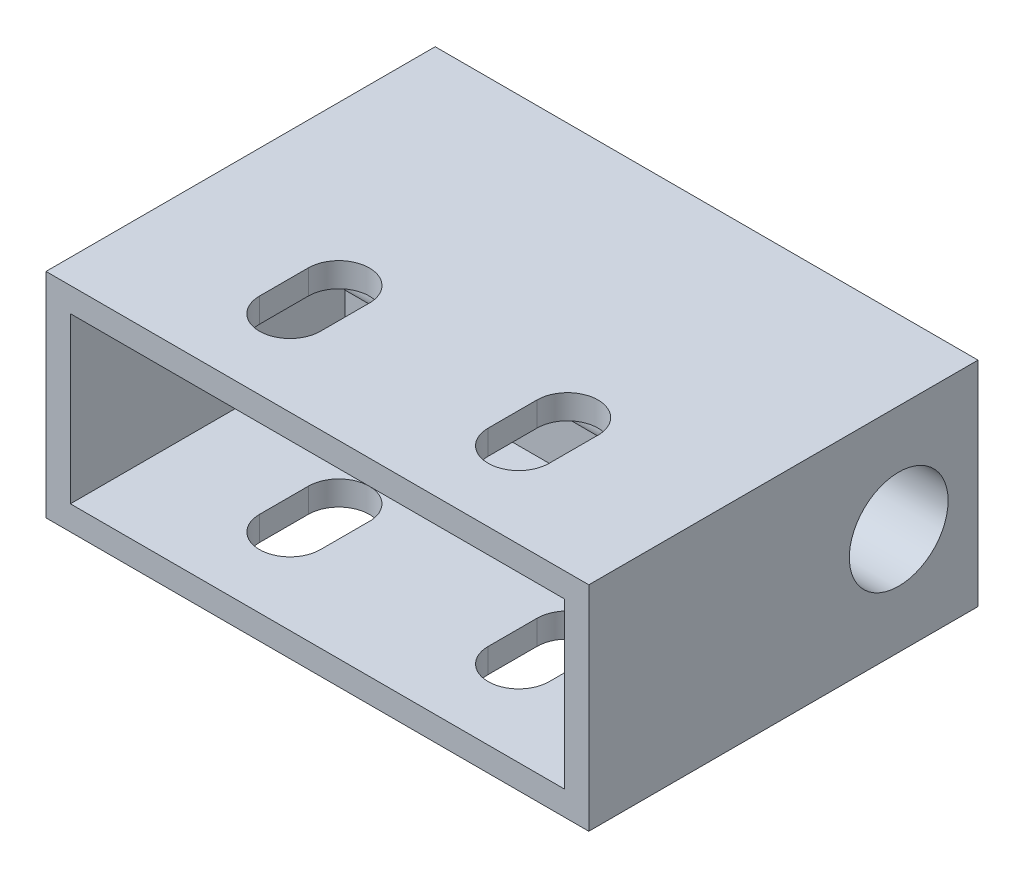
from build123d import *

# Parameters (mm, degrees)
SKETCH1_W           = 22.606
SKETCH1_H           = 16.208375
BOSS_EXTRUDE1_DEPTH = 8.89
SKETCH2_W           = 20.574
SKETCH2_H           = 6.858
CUT_EXTRUDE1_DEPTH  = 11.43
SKETCH5_R           = 2.0574
CUT_EXTRUDE3_DEPTH  = 54.026480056
SKETCH3_R           = 1.27
SKETCH3_R_2         = 1.271976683
CUT_EXTRUDE4_DEPTH  = 22.784480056


with BuildPart() as part:
    # Sketch1 → Boss-Extrude1 (new body)
    with BuildSketch(Plane(origin=(0, 0, 0), x_dir=(1, 0, 0), z_dir=(0, 1, 0))):
        with Locations((11.303, 8.1041875)):
            Rectangle(SKETCH1_W, SKETCH1_H)
    extrude(amount=BOSS_EXTRUDE1_DEPTH)

    # Sketch2 → Cut-Extrude1 (cut)
    with BuildSketch(Plane.XY):
        with Locations((11.303, 4.445)):
            Rectangle(SKETCH2_W, SKETCH2_H)
    extrude(amount=-CUT_EXTRUDE1_DEPTH, mode=Mode.SUBTRACT)

    # Sketch5 → Cut-Extrude3 (cut)
    with BuildSketch(Plane(origin=(22.606, 0, 0), x_dir=(0, 0, -1), z_dir=(1, 0, 0))):
        with Locations((12.906375, 4.445)):
            Circle(SKETCH5_R)
    extrude(amount=-CUT_EXTRUDE3_DEPTH, mode=Mode.SUBTRACT)

    # Sketch3 → Cut-Extrude4 (cut)
    with BuildSketch(Plane(origin=(0, 8.89, 0), x_dir=(1, 0, 0), z_dir=(0, 1, 0))):
        with BuildLine():
            Line((7.874, 3.556), (5.334, 3.556))
            ThreePointArc((5.334, 3.556), (6.604, 2.286), (7.874, 3.556))
        make_face()
        with BuildLine():
            ThreePointArc((5.841341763, 4.571505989), (5.467893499, 4.123593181), (5.334, 3.556))
            Line((5.334, 3.556), (7.874, 3.556))
            ThreePointArc((7.874, 3.556), (7.740658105, 4.122487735), (7.368632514, 4.570020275))
            ThreePointArc((7.368632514, 4.570020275), (6.604739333, 4.316022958), (5.841341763, 4.571505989))
        make_face()
        with BuildLine():
            Line((7.874, 3.556), (7.874, 5.487791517))
            ThreePointArc((7.874, 5.487791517), (7.720198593, 4.974456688), (7.368632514, 4.570020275))
            ThreePointArc((7.368632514, 4.570020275), (7.740658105, 4.122487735), (7.874, 3.556))
        make_face()
        with Locations((6.604, 3.556)):
            Circle(SKETCH3_R)
        with Locations((6.605976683, 5.587999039)):
            Circle(SKETCH3_R_2)
        with BuildLine():
            ThreePointArc((5.841341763, 4.571505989), (5.467881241, 5.019964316), (5.334, 5.587999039))
            Line((5.334, 5.587999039), (5.334, 3.556))
            ThreePointArc((5.334, 3.556), (5.467893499, 4.123593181), (5.841341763, 4.571505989))
        make_face()
        with BuildLine():
            ThreePointArc((15.366341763, 4.571505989), (14.992881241, 5.019964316), (14.859, 5.587999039))
            Line((14.859, 5.587999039), (14.859, 3.556))
            ThreePointArc((14.859, 3.556), (14.992893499, 4.123593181), (15.366341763, 4.571505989))
        make_face()
        with Locations((16.129, 3.556)):
            Circle(SKETCH3_R)
        with Locations((16.130976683, 5.587999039)):
            Circle(SKETCH3_R_2)
        with BuildLine():
            ThreePointArc((15.366341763, 4.571505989), (14.992893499, 4.123593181), (14.859, 3.556))
            Line((14.859, 3.556), (17.399, 3.556))
            ThreePointArc((17.399, 3.556), (17.265658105, 4.122487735), (16.893632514, 4.570020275))
            ThreePointArc((16.893632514, 4.570020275), (16.129739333, 4.316022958), (15.366341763, 4.571505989))
        make_face()
        with BuildLine():
            Line((17.399, 3.556), (17.399, 5.487791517))
            ThreePointArc((17.399, 5.487791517), (17.245198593, 4.974456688), (16.893632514, 4.570020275))
            ThreePointArc((16.893632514, 4.570020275), (17.265658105, 4.122487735), (17.399, 3.556))
        make_face()
        with BuildLine():
            Line((17.399, 3.556), (14.859, 3.556))
            ThreePointArc((14.859, 3.556), (16.129, 2.286), (17.399, 3.556))
        make_face()
        with BuildLine():
            ThreePointArc((7.368632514, 4.570020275), (6.605235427, 4.825999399), (5.841341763, 4.571505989))
            ThreePointArc((5.841341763, 4.571505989), (6.604739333, 4.316022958), (7.368632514, 4.570020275))
        make_face()
        with BuildLine():
            ThreePointArc((16.893632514, 4.570020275), (16.130235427, 4.825999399), (15.366341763, 4.571505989))
            ThreePointArc((15.366341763, 4.571505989), (16.129739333, 4.316022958), (16.893632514, 4.570020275))
        make_face()
    extrude(amount=-CUT_EXTRUDE4_DEPTH, mode=Mode.SUBTRACT)


solid = part.part
